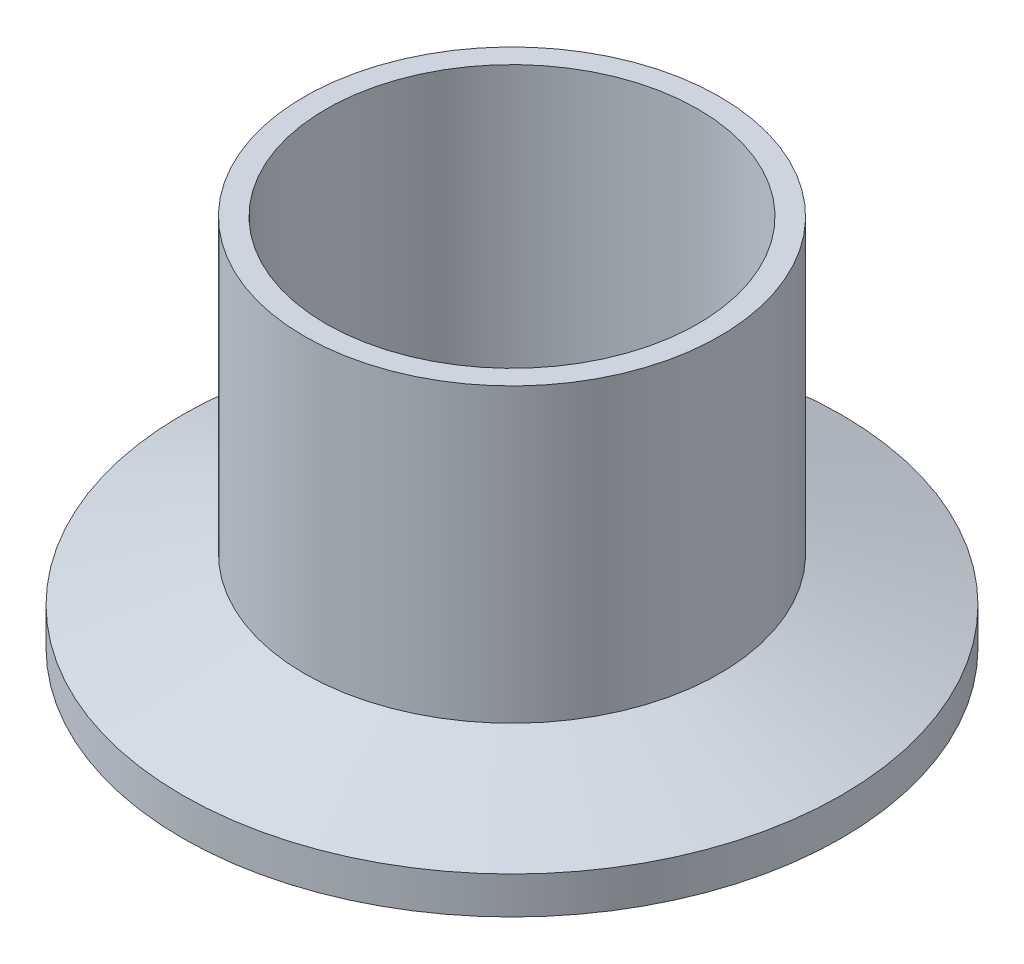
from build123d import *


with BuildPart() as part:
    # Sketch1 → Revolve2 (revolve)
    with BuildSketch(Plane.XY, mode=Mode.PRIVATE) as revolve2_sk:
        with BuildLine():
            Line((-14.224, 0), (-14.224, 28.575))
            Line((-14.224, 28.575), (-15.875, 28.575))
            Line((-15.875, 28.575), (-15.875, 6.23765773))
            Line((-15.875, 6.23765773), (-25.1968, 2.8448))
            Line((-25.1968, 2.8448), (-25.1968, 0))
            Line((-25.1968, 0), (-23.952159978, 0))
            ThreePointArc((-23.952159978, 0), (-23.531583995, 0.126579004), (-23.25073528, 0.46426288))
            Line((-23.25073528, 0.46426288), (-23.077298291, 0.872854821))
            ThreePointArc((-23.077298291, 0.872854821), (-22.04021236, 1.598598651), (-20.933632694, 0.983998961))
            Line((-20.933632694, 0.983998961), (-20.713017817, 0.46426288))
            ThreePointArc((-20.713017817, 0.46426288), (-20.432169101, 0.126579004), (-20.011593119, 0))
            Line((-20.011593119, 0), (-14.224, 0))
        make_face()
    revolve(revolve2_sk.sketch.rotate(Axis((0, 0, 0), (0, 1, 0)), 270), axis=Axis((0, 0, 0), (0, 1, 0)))


solid = part.part
